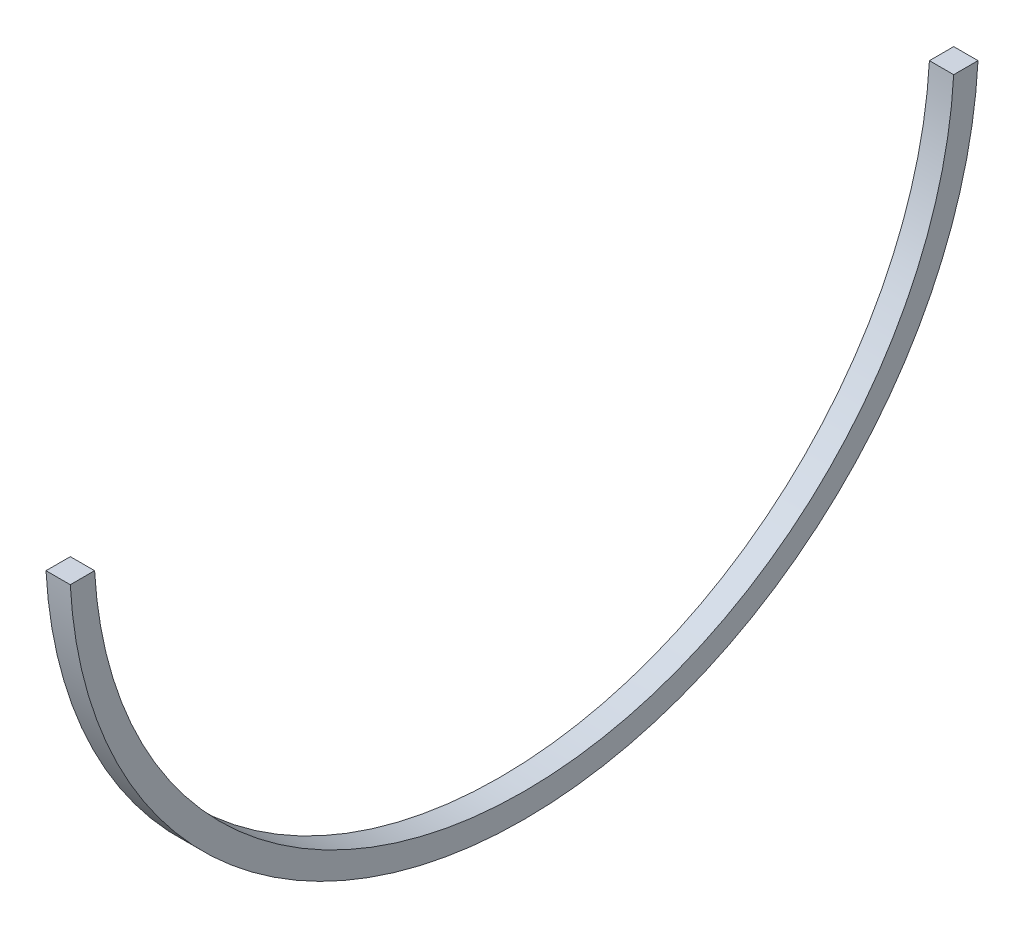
ISO-10303-21;
HEADER;
FILE_DESCRIPTION(('STEP AP214'),'2;1');
FILE_NAME('part.step','',(''),(''),'','','');
FILE_SCHEMA(('AUTOMOTIVE_DESIGN { 1 0 10303 214 1 1 1 1 }'));
ENDSEC;
DATA;
#1=APPLICATION_CONTEXT('core data for automotive mechanical design processes');
#2=APPLICATION_PROTOCOL_DEFINITION('international standard','automotive_design',2000,#1);
#3=PRODUCT_CONTEXT('',#1,'mechanical');
#4=PRODUCT('Part','Part','',(#3));
#5=PRODUCT_RELATED_PRODUCT_CATEGORY('part','',(#4));
#6=PRODUCT_DEFINITION_FORMATION('','',#4);
#7=PRODUCT_DEFINITION_CONTEXT('part definition',#1,'design');
#8=PRODUCT_DEFINITION('design','',#6,#7);
#9=PRODUCT_DEFINITION_SHAPE('','',#8);
#10=(LENGTH_UNIT() NAMED_UNIT(*) SI_UNIT(.MILLI.,.METRE.));
#11=(NAMED_UNIT(*) PLANE_ANGLE_UNIT() SI_UNIT($,.RADIAN.));
#12=(NAMED_UNIT(*) SI_UNIT($,.STERADIAN.) SOLID_ANGLE_UNIT());
#13=UNCERTAINTY_MEASURE_WITH_UNIT(LENGTH_MEASURE(1.E-05),#10,'distance_accuracy_value','');
#14=(GEOMETRIC_REPRESENTATION_CONTEXT(3) GLOBAL_UNCERTAINTY_ASSIGNED_CONTEXT((#13)) GLOBAL_UNIT_ASSIGNED_CONTEXT((#10,
#11,#12)) REPRESENTATION_CONTEXT('',''));
#15=CARTESIAN_POINT('',(0.,0.,0.));
#16=DIRECTION('',(0.,0.,1.));
#17=DIRECTION('',(1.,0.,0.));
#18=AXIS2_PLACEMENT_3D('',#15,#16,#17);
#19=CARTESIAN_POINT('',(833.,-1.66535204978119E-13,0.));
#20=DIRECTION('',(-1.,0.,0.));
#21=DIRECTION('',(0.,-1.,0.));
#22=AXIS2_PLACEMENT_3D('',#19,#20,#21);
#23=CYLINDRICAL_SURFACE('',#22,93.6);
#24=CARTESIAN_POINT('',(828.,-1.6553559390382E-13,0.));
#25=DIRECTION('',(1.,0.,0.));
#26=DIRECTION('',(0.,1.,0.));
#27=AXIS2_PLACEMENT_3D('',#24,#25,#26);
#28=CIRCLE('',#27,93.6);
#29=CARTESIAN_POINT('',(828.,-4.99999999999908,93.4663575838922));
#30=VERTEX_POINT('',#29);
#31=CARTESIAN_POINT('',(828.,-5.00000000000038,-93.4663575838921));
#32=VERTEX_POINT('',#31);
#33=EDGE_CURVE('E98',#30,#32,#28,.T.);
#34=ORIENTED_EDGE('',*,*,#33,.T.);
#35=DIRECTION('',(-1.,0.,0.));
#36=VECTOR('',#35,1.);
#37=CARTESIAN_POINT('',(833.,-5.00000000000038,-93.4663575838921));
#38=LINE('',#37,#36);
#39=CARTESIAN_POINT('',(833.,-5.00000000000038,-93.4663575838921));
#40=VERTEX_POINT('',#39);
#41=EDGE_CURVE('E11',#40,#32,#38,.T.);
#42=ORIENTED_EDGE('',*,*,#41,.F.);
#43=CARTESIAN_POINT('',(833.,-1.66535204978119E-13,0.));
#44=DIRECTION('',(1.,0.,0.));
#45=DIRECTION('',(0.,1.,0.));
#46=AXIS2_PLACEMENT_3D('',#43,#44,#45);
#47=CIRCLE('',#46,93.6);
#48=CARTESIAN_POINT('',(833.,-4.99999999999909,93.4663575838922));
#49=VERTEX_POINT('',#48);
#50=EDGE_CURVE('E86',#49,#40,#47,.T.);
#51=ORIENTED_EDGE('',*,*,#50,.F.);
#52=DIRECTION('',(-1.,0.,0.));
#53=VECTOR('',#52,1.);
#54=CARTESIAN_POINT('',(833.,-4.99999999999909,93.4663575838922));
#55=LINE('',#54,#53);
#56=EDGE_CURVE('E94',#49,#30,#55,.T.);
#57=ORIENTED_EDGE('',*,*,#56,.T.);
#58=EDGE_LOOP('',(#34,#42,#51,#57));
#59=FACE_BOUND('',#58,.T.);
#60=ADVANCED_FACE('F35',(#59),#23,.T.);
#61=CARTESIAN_POINT('',(833.,-5.00000000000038,-93.4663575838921));
#62=DIRECTION('',(0.,-1.,0.));
#63=DIRECTION('',(1.,0.,0.));
#64=AXIS2_PLACEMENT_3D('',#61,#62,#63);
#65=PLANE('',#64);
#66=DIRECTION('',(0.,0.,1.));
#67=VECTOR('',#66,1.);
#68=CARTESIAN_POINT('',(828.,-5.00000000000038,-93.4663575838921));
#69=LINE('',#68,#67);
#70=CARTESIAN_POINT('',(828.,-5.0000000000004,-88.4588039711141));
#71=VERTEX_POINT('',#70);
#72=EDGE_CURVE('E90',#32,#71,#69,.T.);
#73=ORIENTED_EDGE('',*,*,#72,.T.);
#74=DIRECTION('',(-1.,0.,0.));
#75=VECTOR('',#74,1.);
#76=CARTESIAN_POINT('',(833.,-5.0000000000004,-88.4588039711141));
#77=LINE('',#76,#75);
#78=CARTESIAN_POINT('',(833.,-5.0000000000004,-88.4588039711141));
#79=VERTEX_POINT('',#78);
#80=EDGE_CURVE('E43',#79,#71,#77,.T.);
#81=ORIENTED_EDGE('',*,*,#80,.F.);
#82=DIRECTION('',(0.,0.,1.));
#83=VECTOR('',#82,1.);
#84=CARTESIAN_POINT('',(833.,-5.00000000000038,-93.4663575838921));
#85=LINE('',#84,#83);
#86=EDGE_CURVE('E81',#40,#79,#85,.T.);
#87=ORIENTED_EDGE('',*,*,#86,.F.);
#88=ORIENTED_EDGE('',*,*,#41,.T.);
#89=EDGE_LOOP('',(#73,#81,#87,#88));
#90=FACE_BOUND('',#89,.T.);
#91=ADVANCED_FACE('F89',(#90),#65,.F.);
#92=CARTESIAN_POINT('',(833.,-1.66535204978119E-13,0.));
#93=DIRECTION('',(-1.,0.,0.));
#94=DIRECTION('',(0.,-1.,0.));
#95=AXIS2_PLACEMENT_3D('',#92,#93,#94);
#96=CYLINDRICAL_SURFACE('',#95,88.6);
#97=CARTESIAN_POINT('',(828.,-1.6553559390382E-13,0.));
#98=DIRECTION('',(-1.,0.,0.));
#99=DIRECTION('',(0.,1.,0.));
#100=AXIS2_PLACEMENT_3D('',#97,#98,#99);
#101=CIRCLE('',#100,88.6);
#102=CARTESIAN_POINT('',(828.,-4.99999999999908,88.4588039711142));
#103=VERTEX_POINT('',#102);
#104=EDGE_CURVE('E68',#71,#103,#101,.T.);
#105=ORIENTED_EDGE('',*,*,#104,.T.);
#106=DIRECTION('',(-1.,0.,0.));
#107=VECTOR('',#106,1.);
#108=CARTESIAN_POINT('',(833.,-4.99999999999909,88.4588039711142));
#109=LINE('',#108,#107);
#110=CARTESIAN_POINT('',(833.,-4.99999999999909,88.4588039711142));
#111=VERTEX_POINT('',#110);
#112=EDGE_CURVE('E91',#111,#103,#109,.T.);
#113=ORIENTED_EDGE('',*,*,#112,.F.);
#114=CARTESIAN_POINT('',(833.,-1.66535204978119E-13,0.));
#115=DIRECTION('',(-1.,0.,0.));
#116=DIRECTION('',(0.,1.,0.));
#117=AXIS2_PLACEMENT_3D('',#114,#115,#116);
#118=CIRCLE('',#117,88.6);
#119=EDGE_CURVE('E84',#79,#111,#118,.T.);
#120=ORIENTED_EDGE('',*,*,#119,.F.);
#121=ORIENTED_EDGE('',*,*,#80,.T.);
#122=EDGE_LOOP('',(#105,#113,#120,#121));
#123=FACE_BOUND('',#122,.T.);
#124=ADVANCED_FACE('F92',(#123),#96,.F.);
#125=CARTESIAN_POINT('',(833.,-4.99999999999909,88.4588039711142));
#126=DIRECTION('',(0.,-1.,0.));
#127=DIRECTION('',(1.,0.,0.));
#128=AXIS2_PLACEMENT_3D('',#125,#126,#127);
#129=PLANE('',#128);
#130=DIRECTION('',(0.,0.,1.));
#131=VECTOR('',#130,1.);
#132=CARTESIAN_POINT('',(828.,-4.99999999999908,88.4588039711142));
#133=LINE('',#132,#131);
#134=EDGE_CURVE('E74',#103,#30,#133,.T.);
#135=ORIENTED_EDGE('',*,*,#134,.T.);
#136=ORIENTED_EDGE('',*,*,#56,.F.);
#137=DIRECTION('',(0.,0.,1.));
#138=VECTOR('',#137,1.);
#139=CARTESIAN_POINT('',(833.,-4.99999999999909,88.4588039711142));
#140=LINE('',#139,#138);
#141=EDGE_CURVE('E51',#111,#49,#140,.T.);
#142=ORIENTED_EDGE('',*,*,#141,.F.);
#143=ORIENTED_EDGE('',*,*,#112,.T.);
#144=EDGE_LOOP('',(#135,#136,#142,#143));
#145=FACE_BOUND('',#144,.T.);
#146=ADVANCED_FACE('F105',(#145),#129,.F.);
#147=CARTESIAN_POINT('',(833.,-1.66535204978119E-13,0.));
#148=DIRECTION('',(1.,0.,0.));
#149=DIRECTION('',(0.,1.,0.));
#150=AXIS2_PLACEMENT_3D('',#147,#148,#149);
#151=PLANE('',#150);
#152=ORIENTED_EDGE('',*,*,#50,.T.);
#153=ORIENTED_EDGE('',*,*,#86,.T.);
#154=ORIENTED_EDGE('',*,*,#119,.T.);
#155=ORIENTED_EDGE('',*,*,#141,.T.);
#156=EDGE_LOOP('',(#152,#153,#154,#155));
#157=FACE_BOUND('',#156,.T.);
#158=ADVANCED_FACE('F82',(#157),#151,.T.);
#159=CARTESIAN_POINT('',(828.,-1.6553559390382E-13,0.));
#160=DIRECTION('',(1.,0.,0.));
#161=DIRECTION('',(0.,1.,0.));
#162=AXIS2_PLACEMENT_3D('',#159,#160,#161);
#163=PLANE('',#162);
#164=ORIENTED_EDGE('',*,*,#33,.F.);
#165=ORIENTED_EDGE('',*,*,#134,.F.);
#166=ORIENTED_EDGE('',*,*,#104,.F.);
#167=ORIENTED_EDGE('',*,*,#72,.F.);
#168=EDGE_LOOP('',(#164,#165,#166,#167));
#169=FACE_BOUND('',#168,.T.);
#170=ADVANCED_FACE('F108',(#169),#163,.F.);
#171=CLOSED_SHELL('',(#60,#91,#124,#146,#158,#170));
#172=MANIFOLD_SOLID_BREP('B2',#171);
#173=ADVANCED_BREP_SHAPE_REPRESENTATION('',(#18,#172),#14);
#174=SHAPE_DEFINITION_REPRESENTATION(#9,#173);
ENDSEC;
END-ISO-10303-21;
